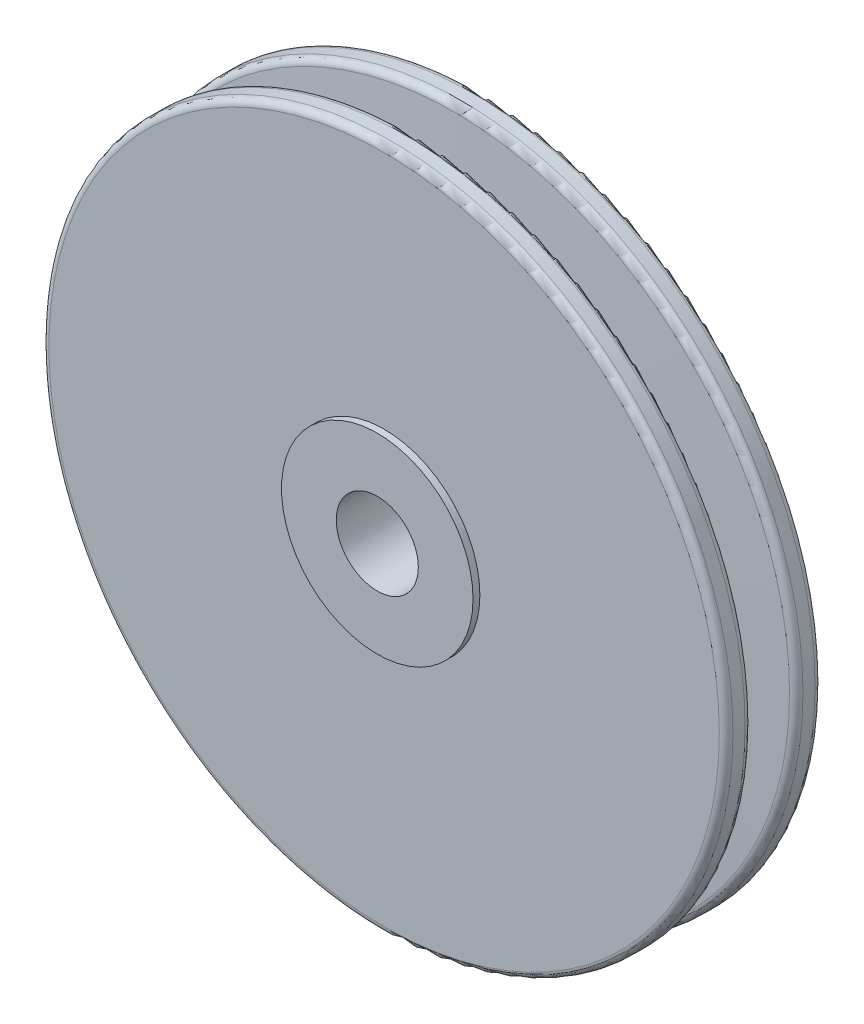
from build123d import *


with BuildPart() as part:
    # Sketch 1 → Revolve 1 (revolve)
    with BuildSketch(Plane(origin=(0, 0, 0), x_dir=(0, 0, -1), z_dir=(1, 0, 0)), mode=Mode.PRIVATE) as revolve_1_sk:
        with BuildLine():
            Line((2.117734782, 25), (3, 25))
            ThreePointArc((3, 25), (3.353553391, 24.853553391), (3.5, 24.5))
            Line((3.5, 24.5), (3.5, 7))
            Line((3.5, 7), (4, 7))
            Line((4, 7), (4, 3))
            Line((4, 3), (-4, 3))
            Line((-4, 3), (-4, 7))
            Line((-4, 7), (-3.5, 7))
            Line((-3.5, 7), (-3.5, 24.5))
            ThreePointArc((-3.5, 24.5), (-3.353553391, 24.853553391), (-3, 25))
            Line((-3, 25), (-2.117734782, 25))
            ThreePointArc((-2.117734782, 25), (-1.770405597, 24.8596699), (-1.618039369, 24.517449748))
            Line((-1.618039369, 24.517449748), (-1.249238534, 13.956375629))
            ThreePointArc((-1.249238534, 13.956375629), (0, 12.75), (1.249238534, 13.956375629))
            Line((1.249238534, 13.956375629), (1.618039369, 24.517449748))
            ThreePointArc((1.618039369, 24.517449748), (1.770405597, 24.8596699), (2.117734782, 25))
        make_face()
    revolve(revolve_1_sk.sketch.rotate(Axis((0, 0, 0), (0, 0, -1)), 90), axis=Axis((0, 0, 0), (0, 0, -1)))


solid = part.part
